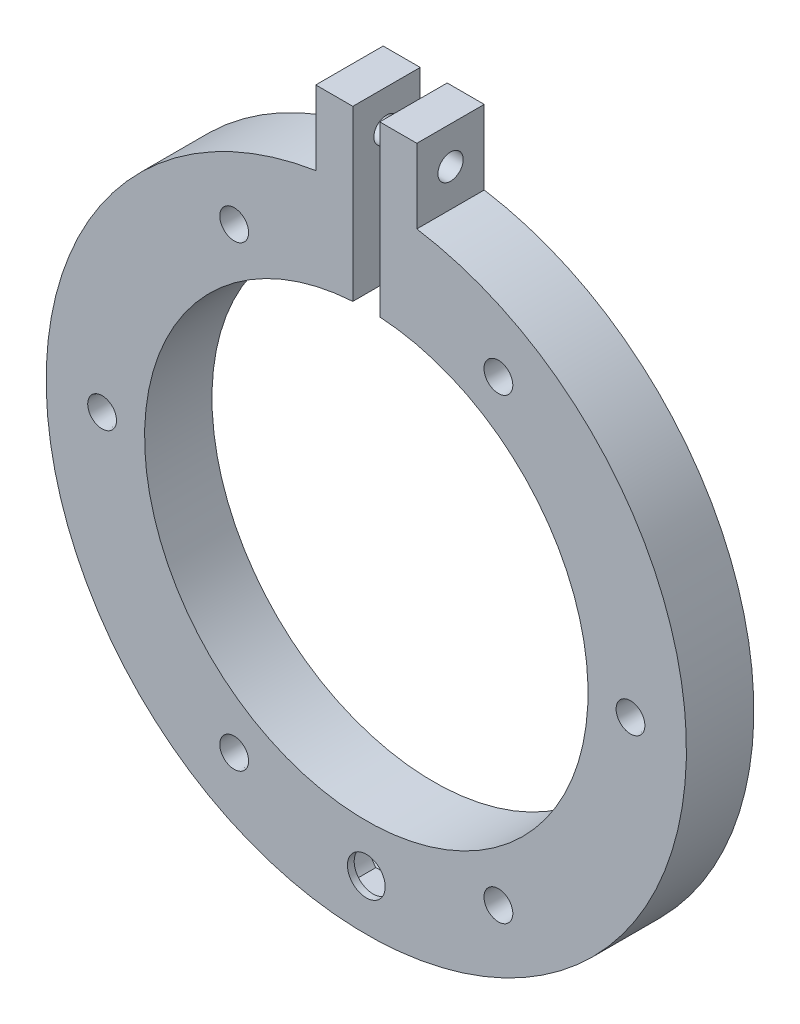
from build123d import *

# Parameters (mm, degrees)
SKETCH1_R                    = 60.325
SKETCH1_R_2                  = 41.783
BOSS_EXTRUDE1_DEPTH          = 12.7
SKETCH2_W                    = 5.08
SKETCH2_H                    = 24.56503019
CUT_EXTRUDE1_DEPTH           = 87.252543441
SKETCH3_W                    = 6.985
SKETCH3_H                    = 20.346530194
BOSS_EXTRUDE2_DEPTH          = 12.7
SKETCH4_R                    = 2.38125
CUT_EXTRUDE2_DEPTH           = 103.220519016
SKETCH5_R                    = 57.15
SKETCH5_R_2                  = 44.45
CUT_EXTRUDE3_DEPTH           = 6.35
SKETCH6_R                    = 2.38125
CUT_EXTRUDE4_DEPTH           = 6.35
CUT_EXTRUDE4_DRAFT           = 3
CUT_EXTRUDE4_PROFILE_2_DEPTH = 6.35
CUT_EXTRUDE4_PROFILE_2_DRAFT = 3
CUT_EXTRUDE4_PROFILE_3_DEPTH = 6.35
CUT_EXTRUDE4_PROFILE_3_DRAFT = 3
CUT_EXTRUDE4_PROFILE_4_DEPTH = 6.35
CUT_EXTRUDE4_PROFILE_4_DRAFT = 3
CUT_EXTRUDE4_PROFILE_5_DEPTH = 6.35
CUT_EXTRUDE4_PROFILE_5_DRAFT = 3
CUT_EXTRUDE4_PROFILE_6_DEPTH = 6.35
CUT_EXTRUDE4_PROFILE_6_DRAFT = 3
SKETCH8_R                    = 2.54
CUT_EXTRUDE6_DEPTH           = 10.161707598
CUT_EXTRUDE7_DEPTH           = 5.08
SKETCH10_R                   = 3.556
CUT_EXTRUDE8_DEPTH           = 96.804345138


with BuildPart() as part:
    # Sketch1 → Boss-Extrude1 (new body)
    with BuildSketch(Plane.XY):
        Circle(SKETCH1_R)
        Circle(SKETCH1_R_2, mode=Mode.SUBTRACT)
    extrude(amount=BOSS_EXTRUDE1_DEPTH)

    # Sketch2 → Cut-Extrude1 (cut, through all)
    with BuildSketch(Plane(origin=(0, 0, 0), x_dir=(-1, 0, 0), z_dir=(0, 0, -1))):
        with Locations((0, 49.850476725)):
            Rectangle(SKETCH2_W, SKETCH2_H)
    extrude(amount=-CUT_EXTRUDE1_DEPTH, mode=Mode.SUBTRACT)

    # Sketch3 → Boss-Extrude2 (add)
    with BuildSketch(Plane(origin=(0, 0, 0), x_dir=(-1, 0, 0), z_dir=(0, 0, -1))):
        with Locations((6.0325, 63.37074899)):
            Rectangle(SKETCH3_W, SKETCH3_H)
        with Locations((-6.0325, 63.37074899)):
            Rectangle(SKETCH3_W, SKETCH3_H)
    extrude(amount=-BOSS_EXTRUDE2_DEPTH)

    # Sketch4 → Cut-Extrude2 (cut, through all)
    with BuildSketch(Plane(origin=(9.525, 0, 0), x_dir=(0, 0, -1), z_dir=(1, 0, 0))):
        with Locations((-6.35, 66.556147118)):
            Circle(SKETCH4_R)
    extrude(amount=-CUT_EXTRUDE2_DEPTH, mode=Mode.SUBTRACT)

    # Sketch5 → Cut-Extrude3 (cut)
    with BuildSketch(Plane(origin=(0, 0, 0), x_dir=(-1, 0, 0), z_dir=(0, 0, -1))):
        Circle(SKETCH5_R)
        Circle(SKETCH5_R_2, mode=Mode.SUBTRACT)
    extrude(amount=-CUT_EXTRUDE3_DEPTH, mode=Mode.SUBTRACT)


with BuildPart() as cut_extrude4_tool:
    # Sketch6 → Cut-Extrude4 (with draft: the straight prism first)
    with BuildSketch(Plane(origin=(0, 0, 6.35), x_dir=(-1, 0, 0), z_dir=(0, 0, -1))):
        with Locations((-24.892, 43.114208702)):
            Circle(SKETCH6_R)
    extrude(amount=-CUT_EXTRUDE4_DEPTH)
    # Cut-Extrude4: the draft: its side faces are tilted about the plane it starts from
    cut_extrude4_sides = [cut_extrude4_tool.faces().sort_by_distance(p)[0] for p in [
        (27.27325, 43.114208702, 9.525),
    ]]
    draft(cut_extrude4_sides, Plane(origin=(0, 0, 6.35), x_dir=(-1, 0, 0), z_dir=(0, 0, -1)), CUT_EXTRUDE4_DRAFT)


with BuildPart() as part_1:
    add(part.part)

    # Cut-Extrude4: cut by cut_extrude4_tool
    add(cut_extrude4_tool.part, mode=Mode.SUBTRACT)


with BuildPart() as cut_extrude4_profile_2_tool:
    # Sketch6 → Cut-Extrude4 profile 2 (with draft: the straight prism first)
    with BuildSketch(Plane(origin=(0, 0, 6.35), x_dir=(-1, 0, 0), z_dir=(0, 0, -1))):
        with Locations((24.892, 43.114208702)):
            Circle(SKETCH6_R)
    extrude(amount=-CUT_EXTRUDE4_PROFILE_2_DEPTH)
    # Cut-Extrude4 profile 2: the draft: its side faces are tilted about the plane it starts from
    cut_extrude4_profile_2_sides = [cut_extrude4_profile_2_tool.faces().sort_by_distance(p)[0] for p in [
        (-22.51075, 43.114208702, 9.525),
    ]]
    draft(cut_extrude4_profile_2_sides, Plane(origin=(0, 0, 6.35), x_dir=(-1, 0, 0), z_dir=(0, 0, -1)), CUT_EXTRUDE4_PROFILE_2_DRAFT)


with BuildPart() as part_2:
    add(part_1.part)

    # Cut-Extrude4 profile 2: cut by cut_extrude4_profile_2_tool
    add(cut_extrude4_profile_2_tool.part, mode=Mode.SUBTRACT)


with BuildPart() as cut_extrude4_profile_3_tool:
    # Sketch6 → Cut-Extrude4 profile 3 (with draft: the straight prism first)
    with BuildSketch(Plane(origin=(0, 0, 6.35), x_dir=(-1, 0, 0), z_dir=(0, 0, -1))):
        with Locations((49.784, 0)):
            Circle(SKETCH6_R)
    extrude(amount=-CUT_EXTRUDE4_PROFILE_3_DEPTH)
    # Cut-Extrude4 profile 3: the draft: its side faces are tilted about the plane it starts from
    cut_extrude4_profile_3_sides = [cut_extrude4_profile_3_tool.faces().sort_by_distance(p)[0] for p in [
        (-47.40275, 0, 9.525),
    ]]
    draft(cut_extrude4_profile_3_sides, Plane(origin=(0, 0, 6.35), x_dir=(-1, 0, 0), z_dir=(0, 0, -1)), CUT_EXTRUDE4_PROFILE_3_DRAFT)


with BuildPart() as part_3:
    add(part_2.part)

    # Cut-Extrude4 profile 3: cut by cut_extrude4_profile_3_tool
    add(cut_extrude4_profile_3_tool.part, mode=Mode.SUBTRACT)


with BuildPart() as cut_extrude4_profile_4_tool:
    # Sketch6 → Cut-Extrude4 profile 4 (with draft: the straight prism first)
    with BuildSketch(Plane(origin=(0, 0, 6.35), x_dir=(-1, 0, 0), z_dir=(0, 0, -1))):
        with Locations((24.892, -43.114208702)):
            Circle(SKETCH6_R)
    extrude(amount=-CUT_EXTRUDE4_PROFILE_4_DEPTH)
    # Cut-Extrude4 profile 4: the draft: its side faces are tilted about the plane it starts from
    cut_extrude4_profile_4_sides = [cut_extrude4_profile_4_tool.faces().sort_by_distance(p)[0] for p in [
        (-22.51075, -43.114208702, 9.525),
    ]]
    draft(cut_extrude4_profile_4_sides, Plane(origin=(0, 0, 6.35), x_dir=(-1, 0, 0), z_dir=(0, 0, -1)), CUT_EXTRUDE4_PROFILE_4_DRAFT)


with BuildPart() as part_4:
    add(part_3.part)

    # Cut-Extrude4 profile 4: cut by cut_extrude4_profile_4_tool
    add(cut_extrude4_profile_4_tool.part, mode=Mode.SUBTRACT)


with BuildPart() as cut_extrude4_profile_5_tool:
    # Sketch6 → Cut-Extrude4 profile 5 (with draft: the straight prism first)
    with BuildSketch(Plane(origin=(0, 0, 6.35), x_dir=(-1, 0, 0), z_dir=(0, 0, -1))):
        with Locations((-24.892, -43.114208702)):
            Circle(SKETCH6_R)
    extrude(amount=-CUT_EXTRUDE4_PROFILE_5_DEPTH)
    # Cut-Extrude4 profile 5: the draft: its side faces are tilted about the plane it starts from
    cut_extrude4_profile_5_sides = [cut_extrude4_profile_5_tool.faces().sort_by_distance(p)[0] for p in [
        (27.27325, -43.114208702, 9.525),
    ]]
    draft(cut_extrude4_profile_5_sides, Plane(origin=(0, 0, 6.35), x_dir=(-1, 0, 0), z_dir=(0, 0, -1)), CUT_EXTRUDE4_PROFILE_5_DRAFT)


with BuildPart() as part_5:
    add(part_4.part)

    # Cut-Extrude4 profile 5: cut by cut_extrude4_profile_5_tool
    add(cut_extrude4_profile_5_tool.part, mode=Mode.SUBTRACT)


with BuildPart() as cut_extrude4_profile_6_tool:
    # Sketch6 → Cut-Extrude4 profile 6 (with draft: the straight prism first)
    with BuildSketch(Plane(origin=(0, 0, 6.35), x_dir=(-1, 0, 0), z_dir=(0, 0, -1))):
        with Locations((-49.784, 0)):
            Circle(SKETCH6_R)
    extrude(amount=-CUT_EXTRUDE4_PROFILE_6_DEPTH)
    # Cut-Extrude4 profile 6: the draft: its side faces are tilted about the plane it starts from
    cut_extrude4_profile_6_sides = [cut_extrude4_profile_6_tool.faces().sort_by_distance(p)[0] for p in [
        (52.16525, 0, 9.525),
    ]]
    draft(cut_extrude4_profile_6_sides, Plane(origin=(0, 0, 6.35), x_dir=(-1, 0, 0), z_dir=(0, 0, -1)), CUT_EXTRUDE4_PROFILE_6_DRAFT)


with BuildPart() as part_6:
    add(part_5.part)

    # Cut-Extrude4 profile 6: cut by cut_extrude4_profile_6_tool
    add(cut_extrude4_profile_6_tool.part, mode=Mode.SUBTRACT)

    # Sketch8 → Cut-Extrude6 (cut)
    with BuildSketch(Plane(origin=(0, -60.325, 0), x_dir=(1, 0, 0), z_dir=(0, 1, 0))):
        with Locations(Location((0, -3.549430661, 0), (0, 0, 90))):
            Circle(SKETCH8_R)
    extrude(amount=CUT_EXTRUDE6_DEPTH, mode=Mode.SUBTRACT)

    # Sketch9 → Cut-Extrude7 (cut)
    with BuildSketch(Plane(origin=(0, 0, 6.35), x_dir=(-1, 0, 0), z_dir=(0, 0, -1))):
        with BuildLine():
            Line((-4.54369013, -54.864), (4.54369013, -54.864))
            ThreePointArc((4.54369013, -54.864), (6.096, -50.8), (4.54369013, -46.736))
            Line((4.54369013, -46.736), (-4.54369013, -46.736))
            ThreePointArc((-4.54369013, -46.736), (-6.096, -50.8), (-4.54369013, -54.864))
        make_face()
    extrude(amount=-CUT_EXTRUDE7_DEPTH, mode=Mode.SUBTRACT)

    # Sketch10 → Cut-Extrude8 (cut, through all)
    with BuildSketch(Plane(origin=(0, 0, 11.43), x_dir=(-1, 0, 0), z_dir=(0, 0, -1))):
        with Locations((0, -50.8)):
            Circle(SKETCH10_R)
    extrude(amount=-CUT_EXTRUDE8_DEPTH, mode=Mode.SUBTRACT)


solid = part_6.part
